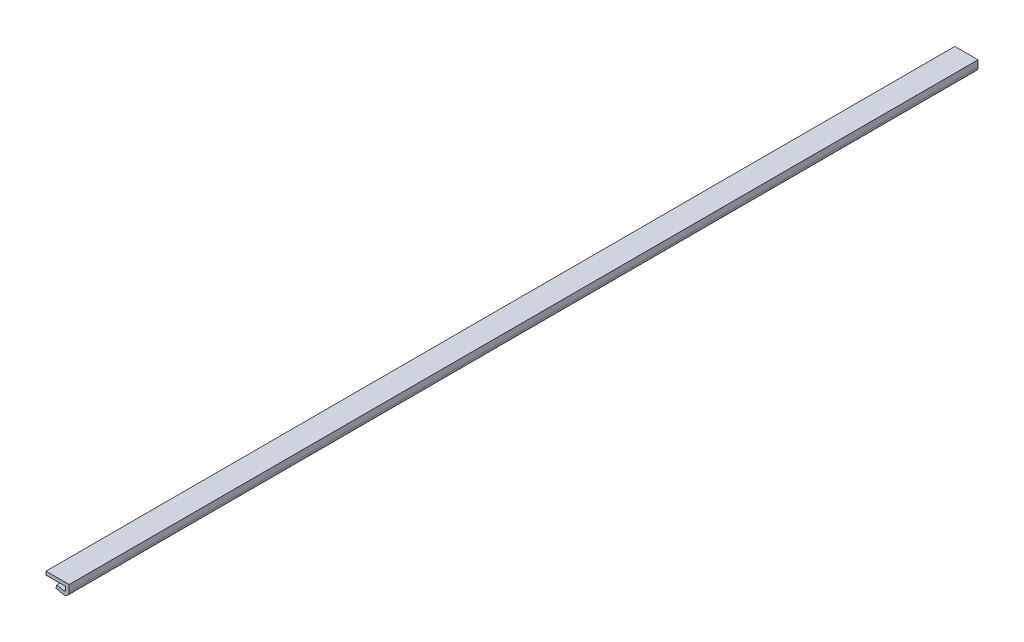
from build123d import *

# Parameters (mm, degrees)
EXTRUSION1_DEPTH = 785


with BuildPart() as part:
    # Esquisse1 → Extrusion1 (new body)
    with BuildSketch(Plane.XY):
        with BuildLine():
            Line((0, 0), (20, 0))
            Line((20, 0), (20, -5.5))
            ThreePointArc((20, -5.5), (18.270476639, -9.046048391), (14.41135147, -9.866330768))
            Line((14.41135147, -9.866330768), (8.573886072, -8.410887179))
            Line((8.573886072, -8.410887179), (9.299651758, -5.5))
            Line((9.299651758, -5.5), (15.137117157, -6.955443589))
            ThreePointArc((15.137117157, -6.955443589), (16.423492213, -6.68201613), (17, -5.5))
            Line((17, -5.5), (17, -3))
            Line((17, -3), (0, -3))
            Line((0, -3), (0, 0))
        make_face()
    extrude(amount=EXTRUSION1_DEPTH)


solid = part.part
